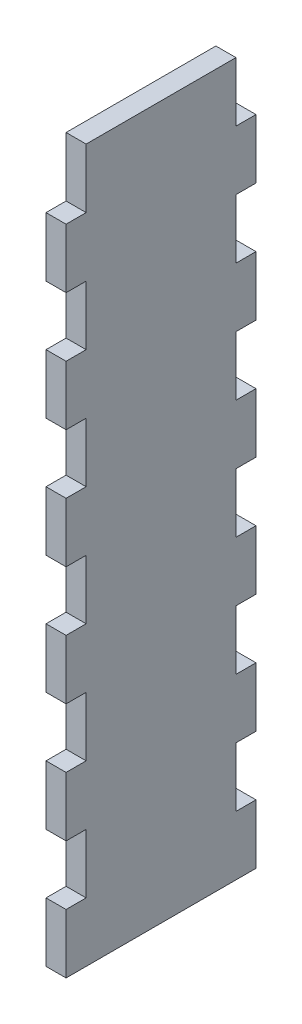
ISO-10303-21;
HEADER;
FILE_DESCRIPTION(('STEP AP214'),'2;1');
FILE_NAME('part.step','',(''),(''),'','','');
FILE_SCHEMA(('AUTOMOTIVE_DESIGN { 1 0 10303 214 1 1 1 1 }'));
ENDSEC;
DATA;
#1=APPLICATION_CONTEXT('core data for automotive mechanical design processes');
#2=APPLICATION_PROTOCOL_DEFINITION('international standard','automotive_design',2000,#1);
#3=PRODUCT_CONTEXT('',#1,'mechanical');
#4=PRODUCT('Part','Part','',(#3));
#5=PRODUCT_RELATED_PRODUCT_CATEGORY('part','',(#4));
#6=PRODUCT_DEFINITION_FORMATION('','',#4);
#7=PRODUCT_DEFINITION_CONTEXT('part definition',#1,'design');
#8=PRODUCT_DEFINITION('design','',#6,#7);
#9=PRODUCT_DEFINITION_SHAPE('','',#8);
#10=(LENGTH_UNIT() NAMED_UNIT(*) SI_UNIT(.MILLI.,.METRE.));
#11=(NAMED_UNIT(*) PLANE_ANGLE_UNIT() SI_UNIT($,.RADIAN.));
#12=(NAMED_UNIT(*) SI_UNIT($,.STERADIAN.) SOLID_ANGLE_UNIT());
#13=UNCERTAINTY_MEASURE_WITH_UNIT(LENGTH_MEASURE(1.E-05),#10,'distance_accuracy_value','');
#14=(GEOMETRIC_REPRESENTATION_CONTEXT(3) GLOBAL_UNCERTAINTY_ASSIGNED_CONTEXT((#13)) GLOBAL_UNIT_ASSIGNED_CONTEXT((#10,
#11,#12)) REPRESENTATION_CONTEXT('',''));
#15=CARTESIAN_POINT('',(0.,0.,0.));
#16=DIRECTION('',(0.,0.,1.));
#17=DIRECTION('',(1.,0.,0.));
#18=AXIS2_PLACEMENT_3D('',#15,#16,#17);
#19=CARTESIAN_POINT('',(3.38,60.,16.));
#20=DIRECTION('',(0.,0.,-1.));
#21=DIRECTION('',(0.,1.,0.));
#22=AXIS2_PLACEMENT_3D('',#19,#20,#21);
#23=PLANE('',#22);
#24=DIRECTION('',(1.,0.,0.));
#25=VECTOR('',#24,1.);
#26=CARTESIAN_POINT('',(0.,9.99999999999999,16.));
#27=LINE('',#26,#25);
#28=CARTESIAN_POINT('',(0.,9.99999999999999,16.));
#29=VERTEX_POINT('',#28);
#30=CARTESIAN_POINT('',(3.38,9.99999999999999,16.));
#31=VERTEX_POINT('',#30);
#32=EDGE_CURVE('E372',#29,#31,#27,.T.);
#33=ORIENTED_EDGE('',*,*,#32,.F.);
#34=DIRECTION('',(0.,-1.,0.));
#35=VECTOR('',#34,1.);
#36=CARTESIAN_POINT('',(0.,60.,16.));
#37=LINE('',#36,#35);
#38=CARTESIAN_POINT('',(0.,0.,16.));
#39=VERTEX_POINT('',#38);
#40=EDGE_CURVE('E695',#29,#39,#37,.T.);
#41=ORIENTED_EDGE('',*,*,#40,.T.);
#42=DIRECTION('',(1.,0.,0.));
#43=VECTOR('',#42,1.);
#44=CARTESIAN_POINT('',(0.,0.,16.));
#45=LINE('',#44,#43);
#46=CARTESIAN_POINT('',(3.38,0.,16.));
#47=VERTEX_POINT('',#46);
#48=EDGE_CURVE('E566',#39,#47,#45,.T.);
#49=ORIENTED_EDGE('',*,*,#48,.T.);
#50=DIRECTION('',(0.,-1.,0.));
#51=VECTOR('',#50,1.);
#52=CARTESIAN_POINT('',(3.38,60.,16.));
#53=LINE('',#52,#51);
#54=EDGE_CURVE('E715',#31,#47,#53,.T.);
#55=ORIENTED_EDGE('',*,*,#54,.F.);
#56=EDGE_LOOP('',(#33,#41,#49,#55));
#57=FACE_BOUND('',#56,.T.);
#58=ADVANCED_FACE('F35',(#57),#23,.F.);
#59=DIRECTION('',(1.,0.,0.));
#60=VECTOR('',#59,1.);
#61=CARTESIAN_POINT('',(0.,20.,16.));
#62=LINE('',#61,#60);
#63=CARTESIAN_POINT('',(0.,20.,16.));
#64=VERTEX_POINT('',#63);
#65=CARTESIAN_POINT('',(3.38,20.,16.));
#66=VERTEX_POINT('',#65);
#67=EDGE_CURVE('E398',#64,#66,#62,.T.);
#68=ORIENTED_EDGE('',*,*,#67,.T.);
#69=CARTESIAN_POINT('',(3.38,30.,16.));
#70=VERTEX_POINT('',#69);
#71=EDGE_CURVE('E649',#70,#66,#53,.T.);
#72=ORIENTED_EDGE('',*,*,#71,.F.);
#73=DIRECTION('',(1.,0.,0.));
#74=VECTOR('',#73,1.);
#75=CARTESIAN_POINT('',(0.,30.,16.));
#76=LINE('',#75,#74);
#77=CARTESIAN_POINT('',(0.,30.,16.));
#78=VERTEX_POINT('',#77);
#79=EDGE_CURVE('E377',#78,#70,#76,.T.);
#80=ORIENTED_EDGE('',*,*,#79,.F.);
#81=EDGE_CURVE('E661',#78,#64,#37,.T.);
#82=ORIENTED_EDGE('',*,*,#81,.T.);
#83=EDGE_LOOP('',(#68,#72,#80,#82));
#84=FACE_BOUND('',#83,.T.);
#85=ADVANCED_FACE('F706',(#84),#23,.F.);
#86=DIRECTION('',(1.,0.,0.));
#87=VECTOR('',#86,1.);
#88=CARTESIAN_POINT('',(0.,-50.,16.));
#89=LINE('',#88,#87);
#90=CARTESIAN_POINT('',(0.,-50.,16.));
#91=VERTEX_POINT('',#90);
#92=CARTESIAN_POINT('',(3.38,-50.,16.));
#93=VERTEX_POINT('',#92);
#94=EDGE_CURVE('E483',#91,#93,#89,.T.);
#95=ORIENTED_EDGE('',*,*,#94,.F.);
#96=CARTESIAN_POINT('',(0.,-60.,16.));
#97=VERTEX_POINT('',#96);
#98=EDGE_CURVE('E657',#91,#97,#37,.T.);
#99=ORIENTED_EDGE('',*,*,#98,.T.);
#100=DIRECTION('',(-1.,0.,0.));
#101=VECTOR('',#100,1.);
#102=CARTESIAN_POINT('',(3.38,-60.,16.));
#103=LINE('',#102,#101);
#104=CARTESIAN_POINT('',(3.38,-60.,16.));
#105=VERTEX_POINT('',#104);
#106=EDGE_CURVE('E12',#105,#97,#103,.T.);
#107=ORIENTED_EDGE('',*,*,#106,.F.);
#108=EDGE_CURVE('E644',#93,#105,#53,.T.);
#109=ORIENTED_EDGE('',*,*,#108,.F.);
#110=EDGE_LOOP('',(#95,#99,#107,#109));
#111=FACE_BOUND('',#110,.T.);
#112=ADVANCED_FACE('F686',(#111),#23,.F.);
#113=DIRECTION('',(1.,0.,0.));
#114=VECTOR('',#113,1.);
#115=CARTESIAN_POINT('',(0.,-40.,16.));
#116=LINE('',#115,#114);
#117=CARTESIAN_POINT('',(0.,-40.,16.));
#118=VERTEX_POINT('',#117);
#119=CARTESIAN_POINT('',(3.38,-40.,16.));
#120=VERTEX_POINT('',#119);
#121=EDGE_CURVE('E515',#118,#120,#116,.T.);
#122=ORIENTED_EDGE('',*,*,#121,.T.);
#123=CARTESIAN_POINT('',(3.38,-30.,16.));
#124=VERTEX_POINT('',#123);
#125=EDGE_CURVE('E720',#124,#120,#53,.T.);
#126=ORIENTED_EDGE('',*,*,#125,.F.);
#127=DIRECTION('',(1.,0.,0.));
#128=VECTOR('',#127,1.);
#129=CARTESIAN_POINT('',(0.,-30.,16.));
#130=LINE('',#129,#128);
#131=CARTESIAN_POINT('',(0.,-30.,16.));
#132=VERTEX_POINT('',#131);
#133=EDGE_CURVE('E488',#132,#124,#130,.T.);
#134=ORIENTED_EDGE('',*,*,#133,.F.);
#135=EDGE_CURVE('E688',#132,#118,#37,.T.);
#136=ORIENTED_EDGE('',*,*,#135,.T.);
#137=EDGE_LOOP('',(#122,#126,#134,#136));
#138=FACE_BOUND('',#137,.T.);
#139=ADVANCED_FACE('F725',(#138),#23,.F.);
#140=DIRECTION('',(1.,0.,0.));
#141=VECTOR('',#140,1.);
#142=CARTESIAN_POINT('',(0.,-20.,16.));
#143=LINE('',#142,#141);
#144=CARTESIAN_POINT('',(0.,-20.,16.));
#145=VERTEX_POINT('',#144);
#146=CARTESIAN_POINT('',(3.38,-20.,16.));
#147=VERTEX_POINT('',#146);
#148=EDGE_CURVE('E491',#145,#147,#143,.T.);
#149=ORIENTED_EDGE('',*,*,#148,.T.);
#150=CARTESIAN_POINT('',(3.38,-10.,16.));
#151=VERTEX_POINT('',#150);
#152=EDGE_CURVE('E717',#151,#147,#53,.T.);
#153=ORIENTED_EDGE('',*,*,#152,.F.);
#154=DIRECTION('',(1.,0.,0.));
#155=VECTOR('',#154,1.);
#156=CARTESIAN_POINT('',(0.,-10.,16.));
#157=LINE('',#156,#155);
#158=CARTESIAN_POINT('',(0.,-10.,16.));
#159=VERTEX_POINT('',#158);
#160=EDGE_CURVE('E563',#159,#151,#157,.T.);
#161=ORIENTED_EDGE('',*,*,#160,.F.);
#162=EDGE_CURVE('E690',#159,#145,#37,.T.);
#163=ORIENTED_EDGE('',*,*,#162,.T.);
#164=EDGE_LOOP('',(#149,#153,#161,#163));
#165=FACE_BOUND('',#164,.T.);
#166=ADVANCED_FACE('F757',(#165),#23,.F.);
#167=CARTESIAN_POINT('',(0.,50.,16.));
#168=VERTEX_POINT('',#167);
#169=CARTESIAN_POINT('',(0.,40.,16.));
#170=VERTEX_POINT('',#169);
#171=EDGE_CURVE('E658',#168,#170,#37,.T.);
#172=ORIENTED_EDGE('',*,*,#171,.T.);
#173=DIRECTION('',(1.,0.,0.));
#174=VECTOR('',#173,1.);
#175=CARTESIAN_POINT('',(0.,40.,16.));
#176=LINE('',#175,#174);
#177=CARTESIAN_POINT('',(3.38,40.,16.));
#178=VERTEX_POINT('',#177);
#179=EDGE_CURVE('E350',#170,#178,#176,.T.);
#180=ORIENTED_EDGE('',*,*,#179,.T.);
#181=CARTESIAN_POINT('',(3.38,50.,16.));
#182=VERTEX_POINT('',#181);
#183=EDGE_CURVE('E645',#182,#178,#53,.T.);
#184=ORIENTED_EDGE('',*,*,#183,.F.);
#185=DIRECTION('',(1.,0.,0.));
#186=VECTOR('',#185,1.);
#187=CARTESIAN_POINT('',(0.,50.,16.));
#188=LINE('',#187,#186);
#189=EDGE_CURVE('E630',#168,#182,#188,.T.);
#190=ORIENTED_EDGE('',*,*,#189,.F.);
#191=EDGE_LOOP('',(#172,#180,#184,#190));
#192=FACE_BOUND('',#191,.T.);
#193=ADVANCED_FACE('F751',(#192),#23,.F.);
#194=CARTESIAN_POINT('',(3.38,0.,0.));
#195=DIRECTION('',(1.,0.,0.));
#196=DIRECTION('',(0.,0.,-1.));
#197=AXIS2_PLACEMENT_3D('',#194,#195,#196);
#198=PLANE('',#197);
#199=DIRECTION('',(0.,0.,-1.));
#200=VECTOR('',#199,1.);
#201=CARTESIAN_POINT('',(3.38,9.99999999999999,0.));
#202=LINE('',#201,#200);
#203=CARTESIAN_POINT('',(3.38,9.99999999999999,-12.62));
#204=VERTEX_POINT('',#203);
#205=CARTESIAN_POINT('',(3.38,9.99999999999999,-16.));
#206=VERTEX_POINT('',#205);
#207=EDGE_CURVE('E407',#204,#206,#202,.T.);
#208=ORIENTED_EDGE('',*,*,#207,.F.);
#209=DIRECTION('',(0.,-1.,0.));
#210=VECTOR('',#209,1.);
#211=CARTESIAN_POINT('',(3.38,0.,-12.62));
#212=LINE('',#211,#210);
#213=CARTESIAN_POINT('',(3.38,20.,-12.62));
#214=VERTEX_POINT('',#213);
#215=EDGE_CURVE('E416',#214,#204,#212,.T.);
#216=ORIENTED_EDGE('',*,*,#215,.F.);
#217=DIRECTION('',(0.,0.,1.));
#218=VECTOR('',#217,1.);
#219=CARTESIAN_POINT('',(3.38,20.,0.));
#220=LINE('',#219,#218);
#221=CARTESIAN_POINT('',(3.38,20.,-16.));
#222=VERTEX_POINT('',#221);
#223=EDGE_CURVE('E413',#222,#214,#220,.T.);
#224=ORIENTED_EDGE('',*,*,#223,.F.);
#225=DIRECTION('',(0.,1.,0.));
#226=VECTOR('',#225,1.);
#227=CARTESIAN_POINT('',(3.38,60.,-16.));
#228=LINE('',#227,#226);
#229=CARTESIAN_POINT('',(3.38,30.,-16.));
#230=VERTEX_POINT('',#229);
#231=EDGE_CURVE('E796',#222,#230,#228,.T.);
#232=ORIENTED_EDGE('',*,*,#231,.T.);
#233=DIRECTION('',(0.,0.,1.));
#234=VECTOR('',#233,1.);
#235=CARTESIAN_POINT('',(3.38,30.,0.));
#236=LINE('',#235,#234);
#237=CARTESIAN_POINT('',(3.38,30.,-12.62));
#238=VERTEX_POINT('',#237);
#239=EDGE_CURVE('E451',#230,#238,#236,.T.);
#240=ORIENTED_EDGE('',*,*,#239,.T.);
#241=DIRECTION('',(0.,1.,0.));
#242=VECTOR('',#241,1.);
#243=CARTESIAN_POINT('',(3.38,0.,-12.62));
#244=LINE('',#243,#242);
#245=CARTESIAN_POINT('',(3.38,40.,-12.62));
#246=VERTEX_POINT('',#245);
#247=EDGE_CURVE('E458',#238,#246,#244,.T.);
#248=ORIENTED_EDGE('',*,*,#247,.T.);
#249=DIRECTION('',(0.,0.,-1.));
#250=VECTOR('',#249,1.);
#251=CARTESIAN_POINT('',(3.38,40.,0.));
#252=LINE('',#251,#250);
#253=CARTESIAN_POINT('',(3.38,40.,-16.));
#254=VERTEX_POINT('',#253);
#255=EDGE_CURVE('E376',#246,#254,#252,.T.);
#256=ORIENTED_EDGE('',*,*,#255,.T.);
#257=CARTESIAN_POINT('',(3.38,50.,-16.));
#258=VERTEX_POINT('',#257);
#259=EDGE_CURVE('E642',#254,#258,#228,.T.);
#260=ORIENTED_EDGE('',*,*,#259,.T.);
#261=DIRECTION('',(0.,0.,-1.));
#262=VECTOR('',#261,1.);
#263=CARTESIAN_POINT('',(3.38,49.9999999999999,2.05292719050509E-13));
#264=LINE('',#263,#262);
#265=CARTESIAN_POINT('',(3.38,50.,-12.62));
#266=VERTEX_POINT('',#265);
#267=EDGE_CURVE('E432',#266,#258,#264,.T.);
#268=ORIENTED_EDGE('',*,*,#267,.F.);
#269=DIRECTION('',(0.,-1.,0.));
#270=VECTOR('',#269,1.);
#271=CARTESIAN_POINT('',(3.38,0.,-12.62));
#272=LINE('',#271,#270);
#273=CARTESIAN_POINT('',(3.38,60.,-12.62));
#274=VERTEX_POINT('',#273);
#275=EDGE_CURVE('E436',#274,#266,#272,.T.);
#276=ORIENTED_EDGE('',*,*,#275,.F.);
#277=DIRECTION('',(0.,0.,1.));
#278=VECTOR('',#277,1.);
#279=CARTESIAN_POINT('',(3.38,60.,16.));
#280=LINE('',#279,#278);
#281=CARTESIAN_POINT('',(3.38,60.,12.62));
#282=VERTEX_POINT('',#281);
#283=EDGE_CURVE('E640',#274,#282,#280,.T.);
#284=ORIENTED_EDGE('',*,*,#283,.T.);
#285=DIRECTION('',(0.,-1.,0.));
#286=VECTOR('',#285,1.);
#287=CARTESIAN_POINT('',(3.38,0.,12.62));
#288=LINE('',#287,#286);
#289=CARTESIAN_POINT('',(3.38,50.,12.62));
#290=VERTEX_POINT('',#289);
#291=EDGE_CURVE('E623',#282,#290,#288,.T.);
#292=ORIENTED_EDGE('',*,*,#291,.T.);
#293=DIRECTION('',(0.,0.,1.));
#294=VECTOR('',#293,1.);
#295=CARTESIAN_POINT('',(3.38,50.,-1.02646359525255E-13));
#296=LINE('',#295,#294);
#297=EDGE_CURVE('E444',#290,#182,#296,.T.);
#298=ORIENTED_EDGE('',*,*,#297,.T.);
#299=ORIENTED_EDGE('',*,*,#183,.T.);
#300=DIRECTION('',(0.,0.,1.));
#301=VECTOR('',#300,1.);
#302=CARTESIAN_POINT('',(3.38,40.,0.));
#303=LINE('',#302,#301);
#304=CARTESIAN_POINT('',(3.38,40.,12.62));
#305=VERTEX_POINT('',#304);
#306=EDGE_CURVE('E367',#305,#178,#303,.T.);
#307=ORIENTED_EDGE('',*,*,#306,.F.);
#308=DIRECTION('',(0.,1.,0.));
#309=VECTOR('',#308,1.);
#310=CARTESIAN_POINT('',(3.38,0.,12.62));
#311=LINE('',#310,#309);
#312=CARTESIAN_POINT('',(3.38,30.,12.62));
#313=VERTEX_POINT('',#312);
#314=EDGE_CURVE('E347',#313,#305,#311,.T.);
#315=ORIENTED_EDGE('',*,*,#314,.F.);
#316=DIRECTION('',(0.,0.,-1.));
#317=VECTOR('',#316,1.);
#318=CARTESIAN_POINT('',(3.38,30.,0.));
#319=LINE('',#318,#317);
#320=EDGE_CURVE('E364',#70,#313,#319,.T.);
#321=ORIENTED_EDGE('',*,*,#320,.F.);
#322=ORIENTED_EDGE('',*,*,#71,.T.);
#323=DIRECTION('',(0.,0.,-1.));
#324=VECTOR('',#323,1.);
#325=CARTESIAN_POINT('',(3.38,20.,0.));
#326=LINE('',#325,#324);
#327=CARTESIAN_POINT('',(3.38,20.,12.62));
#328=VERTEX_POINT('',#327);
#329=EDGE_CURVE('E383',#66,#328,#326,.T.);
#330=ORIENTED_EDGE('',*,*,#329,.T.);
#331=DIRECTION('',(0.,-1.,0.));
#332=VECTOR('',#331,1.);
#333=CARTESIAN_POINT('',(3.38,0.,12.62));
#334=LINE('',#333,#332);
#335=CARTESIAN_POINT('',(3.38,9.99999999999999,12.62));
#336=VERTEX_POINT('',#335);
#337=EDGE_CURVE('E391',#328,#336,#334,.T.);
#338=ORIENTED_EDGE('',*,*,#337,.T.);
#339=DIRECTION('',(0.,0.,1.));
#340=VECTOR('',#339,1.);
#341=CARTESIAN_POINT('',(3.38,9.99999999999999,0.));
#342=LINE('',#341,#340);
#343=EDGE_CURVE('E388',#336,#31,#342,.T.);
#344=ORIENTED_EDGE('',*,*,#343,.T.);
#345=ORIENTED_EDGE('',*,*,#54,.T.);
#346=DIRECTION('',(0.,0.,-1.));
#347=VECTOR('',#346,1.);
#348=CARTESIAN_POINT('',(3.38,0.,0.));
#349=LINE('',#348,#347);
#350=CARTESIAN_POINT('',(3.38,0.,12.62));
#351=VERTEX_POINT('',#350);
#352=EDGE_CURVE('E548',#47,#351,#349,.T.);
#353=ORIENTED_EDGE('',*,*,#352,.T.);
#354=DIRECTION('',(0.,-1.,0.));
#355=VECTOR('',#354,1.);
#356=CARTESIAN_POINT('',(3.38,0.,12.62));
#357=LINE('',#356,#355);
#358=CARTESIAN_POINT('',(3.38,-10.,12.62));
#359=VERTEX_POINT('',#358);
#360=EDGE_CURVE('E557',#351,#359,#357,.T.);
#361=ORIENTED_EDGE('',*,*,#360,.T.);
#362=DIRECTION('',(0.,0.,1.));
#363=VECTOR('',#362,1.);
#364=CARTESIAN_POINT('',(3.38,-10.,0.));
#365=LINE('',#364,#363);
#366=EDGE_CURVE('E554',#359,#151,#365,.T.);
#367=ORIENTED_EDGE('',*,*,#366,.T.);
#368=ORIENTED_EDGE('',*,*,#152,.T.);
#369=DIRECTION('',(0.,0.,-1.));
#370=VECTOR('',#369,1.);
#371=CARTESIAN_POINT('',(3.38,-20.,0.));
#372=LINE('',#371,#370);
#373=CARTESIAN_POINT('',(3.38,-20.,12.62));
#374=VERTEX_POINT('',#373);
#375=EDGE_CURVE('E473',#147,#374,#372,.T.);
#376=ORIENTED_EDGE('',*,*,#375,.T.);
#377=DIRECTION('',(0.,-1.,0.));
#378=VECTOR('',#377,1.);
#379=CARTESIAN_POINT('',(3.38,0.,12.62));
#380=LINE('',#379,#378);
#381=CARTESIAN_POINT('',(3.38,-30.,12.62));
#382=VERTEX_POINT('',#381);
#383=EDGE_CURVE('E482',#374,#382,#380,.T.);
#384=ORIENTED_EDGE('',*,*,#383,.T.);
#385=DIRECTION('',(0.,0.,1.));
#386=VECTOR('',#385,1.);
#387=CARTESIAN_POINT('',(3.38,-30.,0.));
#388=LINE('',#387,#386);
#389=EDGE_CURVE('E479',#382,#124,#388,.T.);
#390=ORIENTED_EDGE('',*,*,#389,.T.);
#391=ORIENTED_EDGE('',*,*,#125,.T.);
#392=DIRECTION('',(0.,0.,-1.));
#393=VECTOR('',#392,1.);
#394=CARTESIAN_POINT('',(3.38,-40.,0.));
#395=LINE('',#394,#393);
#396=CARTESIAN_POINT('',(3.38,-40.,12.62));
#397=VERTEX_POINT('',#396);
#398=EDGE_CURVE('E500',#120,#397,#395,.T.);
#399=ORIENTED_EDGE('',*,*,#398,.T.);
#400=DIRECTION('',(0.,-1.,0.));
#401=VECTOR('',#400,1.);
#402=CARTESIAN_POINT('',(3.38,0.,12.62));
#403=LINE('',#402,#401);
#404=CARTESIAN_POINT('',(3.38,-50.,12.62));
#405=VERTEX_POINT('',#404);
#406=EDGE_CURVE('E508',#397,#405,#403,.T.);
#407=ORIENTED_EDGE('',*,*,#406,.T.);
#408=DIRECTION('',(0.,0.,1.));
#409=VECTOR('',#408,1.);
#410=CARTESIAN_POINT('',(3.38,-50.,0.));
#411=LINE('',#410,#409);
#412=EDGE_CURVE('E505',#405,#93,#411,.T.);
#413=ORIENTED_EDGE('',*,*,#412,.T.);
#414=ORIENTED_EDGE('',*,*,#108,.T.);
#415=DIRECTION('',(0.,0.,-1.));
#416=VECTOR('',#415,1.);
#417=CARTESIAN_POINT('',(3.38,-60.,16.));
#418=LINE('',#417,#416);
#419=CARTESIAN_POINT('',(3.38,-60.,-16.));
#420=VERTEX_POINT('',#419);
#421=EDGE_CURVE('E648',#105,#420,#418,.T.);
#422=ORIENTED_EDGE('',*,*,#421,.T.);
#423=CARTESIAN_POINT('',(3.38,-50.,-16.));
#424=VERTEX_POINT('',#423);
#425=EDGE_CURVE('E637',#420,#424,#228,.T.);
#426=ORIENTED_EDGE('',*,*,#425,.T.);
#427=DIRECTION('',(0.,0.,-1.));
#428=VECTOR('',#427,1.);
#429=CARTESIAN_POINT('',(3.38,-50.,-1.02646359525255E-13));
#430=LINE('',#429,#428);
#431=CARTESIAN_POINT('',(3.38,-50.,-12.62));
#432=VERTEX_POINT('',#431);
#433=EDGE_CURVE('E524',#432,#424,#430,.T.);
#434=ORIENTED_EDGE('',*,*,#433,.F.);
#435=DIRECTION('',(0.,-1.,0.));
#436=VECTOR('',#435,1.);
#437=CARTESIAN_POINT('',(3.38,0.,-12.62));
#438=LINE('',#437,#436);
#439=CARTESIAN_POINT('',(3.38,-40.,-12.62));
#440=VERTEX_POINT('',#439);
#441=EDGE_CURVE('E534',#440,#432,#438,.T.);
#442=ORIENTED_EDGE('',*,*,#441,.F.);
#443=DIRECTION('',(0.,0.,1.));
#444=VECTOR('',#443,1.);
#445=CARTESIAN_POINT('',(3.38,-40.,0.));
#446=LINE('',#445,#444);
#447=CARTESIAN_POINT('',(3.38,-40.,-16.));
#448=VERTEX_POINT('',#447);
#449=EDGE_CURVE('E531',#448,#440,#446,.T.);
#450=ORIENTED_EDGE('',*,*,#449,.F.);
#451=CARTESIAN_POINT('',(3.38,-30.,-16.));
#452=VERTEX_POINT('',#451);
#453=EDGE_CURVE('E641',#448,#452,#228,.T.);
#454=ORIENTED_EDGE('',*,*,#453,.T.);
#455=DIRECTION('',(0.,0.,-1.));
#456=VECTOR('',#455,1.);
#457=CARTESIAN_POINT('',(3.38,-30.,0.));
#458=LINE('',#457,#456);
#459=CARTESIAN_POINT('',(3.38,-30.,-12.62));
#460=VERTEX_POINT('',#459);
#461=EDGE_CURVE('E576',#460,#452,#458,.T.);
#462=ORIENTED_EDGE('',*,*,#461,.F.);
#463=DIRECTION('',(0.,-1.,0.));
#464=VECTOR('',#463,1.);
#465=CARTESIAN_POINT('',(3.38,0.,-12.62));
#466=LINE('',#465,#464);
#467=CARTESIAN_POINT('',(3.38,-20.,-12.62));
#468=VERTEX_POINT('',#467);
#469=EDGE_CURVE('E585',#468,#460,#466,.T.);
#470=ORIENTED_EDGE('',*,*,#469,.F.);
#471=DIRECTION('',(0.,0.,1.));
#472=VECTOR('',#471,1.);
#473=CARTESIAN_POINT('',(3.38,-20.,0.));
#474=LINE('',#473,#472);
#475=CARTESIAN_POINT('',(3.38,-20.,-16.));
#476=VERTEX_POINT('',#475);
#477=EDGE_CURVE('E490',#476,#468,#474,.T.);
#478=ORIENTED_EDGE('',*,*,#477,.F.);
#479=CARTESIAN_POINT('',(3.38,-10.,-16.));
#480=VERTEX_POINT('',#479);
#481=EDGE_CURVE('E802',#476,#480,#228,.T.);
#482=ORIENTED_EDGE('',*,*,#481,.T.);
#483=DIRECTION('',(0.,0.,-1.));
#484=VECTOR('',#483,1.);
#485=CARTESIAN_POINT('',(3.38,-10.,0.));
#486=LINE('',#485,#484);
#487=CARTESIAN_POINT('',(3.38,-10.,-12.62));
#488=VERTEX_POINT('',#487);
#489=EDGE_CURVE('E600',#488,#480,#486,.T.);
#490=ORIENTED_EDGE('',*,*,#489,.F.);
#491=DIRECTION('',(0.,-1.,0.));
#492=VECTOR('',#491,1.);
#493=CARTESIAN_POINT('',(3.38,0.,-12.62));
#494=LINE('',#493,#492);
#495=CARTESIAN_POINT('',(3.38,0.,-12.62));
#496=VERTEX_POINT('',#495);
#497=EDGE_CURVE('E609',#496,#488,#494,.T.);
#498=ORIENTED_EDGE('',*,*,#497,.F.);
#499=DIRECTION('',(0.,0.,1.));
#500=VECTOR('',#499,1.);
#501=CARTESIAN_POINT('',(3.38,0.,0.));
#502=LINE('',#501,#500);
#503=CARTESIAN_POINT('',(3.38,0.,-16.));
#504=VERTEX_POINT('',#503);
#505=EDGE_CURVE('E565',#504,#496,#502,.T.);
#506=ORIENTED_EDGE('',*,*,#505,.F.);
#507=EDGE_CURVE('E798',#504,#206,#228,.T.);
#508=ORIENTED_EDGE('',*,*,#507,.T.);
#509=EDGE_LOOP('',(#208,#216,#224,#232,#240,#248,#256,#260,#268,#276,#284,#292,#298,#299,#307,
#315,#321,#322,#330,#338,#344,#345,#353,#361,#367,#368,#376,#384,#390,#391,#399,#407,#413,#414,
#422,#426,#434,#442,#450,#454,#462,#470,#478,#482,#490,#498,#506,#508));
#510=FACE_BOUND('',#509,.T.);
#511=ADVANCED_FACE('F679',(#510),#198,.T.);
#512=CARTESIAN_POINT('',(0.,0.,0.));
#513=DIRECTION('',(1.,0.,0.));
#514=DIRECTION('',(0.,0.,-1.));
#515=AXIS2_PLACEMENT_3D('',#512,#513,#514);
#516=PLANE('',#515);
#517=DIRECTION('',(0.,-1.,0.));
#518=VECTOR('',#517,1.);
#519=CARTESIAN_POINT('',(0.,0.,-12.62));
#520=LINE('',#519,#518);
#521=CARTESIAN_POINT('',(0.,20.,-12.62));
#522=VERTEX_POINT('',#521);
#523=CARTESIAN_POINT('',(0.,9.99999999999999,-12.62));
#524=VERTEX_POINT('',#523);
#525=EDGE_CURVE('E406',#522,#524,#520,.T.);
#526=ORIENTED_EDGE('',*,*,#525,.T.);
#527=DIRECTION('',(0.,0.,-1.));
#528=VECTOR('',#527,1.);
#529=CARTESIAN_POINT('',(0.,9.99999999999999,0.));
#530=LINE('',#529,#528);
#531=CARTESIAN_POINT('',(0.,9.99999999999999,-16.));
#532=VERTEX_POINT('',#531);
#533=EDGE_CURVE('E409',#524,#532,#530,.T.);
#534=ORIENTED_EDGE('',*,*,#533,.T.);
#535=DIRECTION('',(0.,1.,0.));
#536=VECTOR('',#535,1.);
#537=CARTESIAN_POINT('',(0.,60.,-16.));
#538=LINE('',#537,#536);
#539=CARTESIAN_POINT('',(0.,0.,-16.));
#540=VERTEX_POINT('',#539);
#541=EDGE_CURVE('E844',#540,#532,#538,.T.);
#542=ORIENTED_EDGE('',*,*,#541,.F.);
#543=DIRECTION('',(0.,0.,1.));
#544=VECTOR('',#543,1.);
#545=CARTESIAN_POINT('',(0.,0.,0.));
#546=LINE('',#545,#544);
#547=CARTESIAN_POINT('',(0.,0.,-12.62));
#548=VERTEX_POINT('',#547);
#549=EDGE_CURVE('E596',#540,#548,#546,.T.);
#550=ORIENTED_EDGE('',*,*,#549,.T.);
#551=DIRECTION('',(0.,-1.,0.));
#552=VECTOR('',#551,1.);
#553=CARTESIAN_POINT('',(0.,0.,-12.62));
#554=LINE('',#553,#552);
#555=CARTESIAN_POINT('',(0.,-10.,-12.62));
#556=VERTEX_POINT('',#555);
#557=EDGE_CURVE('E599',#548,#556,#554,.T.);
#558=ORIENTED_EDGE('',*,*,#557,.T.);
#559=DIRECTION('',(0.,0.,-1.));
#560=VECTOR('',#559,1.);
#561=CARTESIAN_POINT('',(0.,-10.,0.));
#562=LINE('',#561,#560);
#563=CARTESIAN_POINT('',(0.,-10.,-16.));
#564=VERTEX_POINT('',#563);
#565=EDGE_CURVE('E603',#556,#564,#562,.T.);
#566=ORIENTED_EDGE('',*,*,#565,.T.);
#567=CARTESIAN_POINT('',(0.,-20.,-16.));
#568=VERTEX_POINT('',#567);
#569=EDGE_CURVE('E831',#568,#564,#538,.T.);
#570=ORIENTED_EDGE('',*,*,#569,.F.);
#571=DIRECTION('',(0.,0.,1.));
#572=VECTOR('',#571,1.);
#573=CARTESIAN_POINT('',(0.,-20.,0.));
#574=LINE('',#573,#572);
#575=CARTESIAN_POINT('',(0.,-20.,-12.62));
#576=VERTEX_POINT('',#575);
#577=EDGE_CURVE('E572',#568,#576,#574,.T.);
#578=ORIENTED_EDGE('',*,*,#577,.T.);
#579=DIRECTION('',(0.,-1.,0.));
#580=VECTOR('',#579,1.);
#581=CARTESIAN_POINT('',(0.,0.,-12.62));
#582=LINE('',#581,#580);
#583=CARTESIAN_POINT('',(0.,-30.,-12.62));
#584=VERTEX_POINT('',#583);
#585=EDGE_CURVE('E575',#576,#584,#582,.T.);
#586=ORIENTED_EDGE('',*,*,#585,.T.);
#587=DIRECTION('',(0.,0.,-1.));
#588=VECTOR('',#587,1.);
#589=CARTESIAN_POINT('',(0.,-30.,0.));
#590=LINE('',#589,#588);
#591=CARTESIAN_POINT('',(0.,-30.,-16.));
#592=VERTEX_POINT('',#591);
#593=EDGE_CURVE('E579',#584,#592,#590,.T.);
#594=ORIENTED_EDGE('',*,*,#593,.T.);
#595=CARTESIAN_POINT('',(0.,-40.,-16.));
#596=VERTEX_POINT('',#595);
#597=EDGE_CURVE('E655',#596,#592,#538,.T.);
#598=ORIENTED_EDGE('',*,*,#597,.F.);
#599=DIRECTION('',(0.,0.,1.));
#600=VECTOR('',#599,1.);
#601=CARTESIAN_POINT('',(0.,-40.,0.));
#602=LINE('',#601,#600);
#603=CARTESIAN_POINT('',(0.,-40.,-12.62));
#604=VERTEX_POINT('',#603);
#605=EDGE_CURVE('E520',#596,#604,#602,.T.);
#606=ORIENTED_EDGE('',*,*,#605,.T.);
#607=DIRECTION('',(0.,-1.,0.));
#608=VECTOR('',#607,1.);
#609=CARTESIAN_POINT('',(0.,0.,-12.62));
#610=LINE('',#609,#608);
#611=CARTESIAN_POINT('',(0.,-50.,-12.62));
#612=VERTEX_POINT('',#611);
#613=EDGE_CURVE('E523',#604,#612,#610,.T.);
#614=ORIENTED_EDGE('',*,*,#613,.T.);
#615=DIRECTION('',(0.,0.,-1.));
#616=VECTOR('',#615,1.);
#617=CARTESIAN_POINT('',(0.,-50.,-1.02646359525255E-13));
#618=LINE('',#617,#616);
#619=CARTESIAN_POINT('',(0.,-50.,-16.));
#620=VERTEX_POINT('',#619);
#621=EDGE_CURVE('E527',#612,#620,#618,.T.);
#622=ORIENTED_EDGE('',*,*,#621,.T.);
#623=CARTESIAN_POINT('',(0.,-60.,-16.));
#624=VERTEX_POINT('',#623);
#625=EDGE_CURVE('E651',#624,#620,#538,.T.);
#626=ORIENTED_EDGE('',*,*,#625,.F.);
#627=DIRECTION('',(0.,0.,-1.));
#628=VECTOR('',#627,1.);
#629=CARTESIAN_POINT('',(0.,-60.,16.));
#630=LINE('',#629,#628);
#631=EDGE_CURVE('E660',#97,#624,#630,.T.);
#632=ORIENTED_EDGE('',*,*,#631,.F.);
#633=ORIENTED_EDGE('',*,*,#98,.F.);
#634=DIRECTION('',(0.,0.,1.));
#635=VECTOR('',#634,1.);
#636=CARTESIAN_POINT('',(0.,-50.,0.));
#637=LINE('',#636,#635);
#638=CARTESIAN_POINT('',(0.,-50.,12.62));
#639=VERTEX_POINT('',#638);
#640=EDGE_CURVE('E497',#639,#91,#637,.T.);
#641=ORIENTED_EDGE('',*,*,#640,.F.);
#642=DIRECTION('',(0.,-1.,0.));
#643=VECTOR('',#642,1.);
#644=CARTESIAN_POINT('',(0.,0.,12.62));
#645=LINE('',#644,#643);
#646=CARTESIAN_POINT('',(0.,-40.,12.62));
#647=VERTEX_POINT('',#646);
#648=EDGE_CURVE('E499',#647,#639,#645,.T.);
#649=ORIENTED_EDGE('',*,*,#648,.F.);
#650=DIRECTION('',(0.,0.,-1.));
#651=VECTOR('',#650,1.);
#652=CARTESIAN_POINT('',(0.,-40.,0.));
#653=LINE('',#652,#651);
#654=EDGE_CURVE('E502',#118,#647,#653,.T.);
#655=ORIENTED_EDGE('',*,*,#654,.F.);
#656=ORIENTED_EDGE('',*,*,#135,.F.);
#657=DIRECTION('',(0.,0.,1.));
#658=VECTOR('',#657,1.);
#659=CARTESIAN_POINT('',(0.,-30.,0.));
#660=LINE('',#659,#658);
#661=CARTESIAN_POINT('',(0.,-30.,12.62));
#662=VERTEX_POINT('',#661);
#663=EDGE_CURVE('E470',#662,#132,#660,.T.);
#664=ORIENTED_EDGE('',*,*,#663,.F.);
#665=DIRECTION('',(0.,-1.,0.));
#666=VECTOR('',#665,1.);
#667=CARTESIAN_POINT('',(0.,0.,12.62));
#668=LINE('',#667,#666);
#669=CARTESIAN_POINT('',(0.,-20.,12.62));
#670=VERTEX_POINT('',#669);
#671=EDGE_CURVE('E472',#670,#662,#668,.T.);
#672=ORIENTED_EDGE('',*,*,#671,.F.);
#673=DIRECTION('',(0.,0.,-1.));
#674=VECTOR('',#673,1.);
#675=CARTESIAN_POINT('',(0.,-20.,0.));
#676=LINE('',#675,#674);
#677=EDGE_CURVE('E475',#145,#670,#676,.T.);
#678=ORIENTED_EDGE('',*,*,#677,.F.);
#679=ORIENTED_EDGE('',*,*,#162,.F.);
#680=DIRECTION('',(0.,0.,1.));
#681=VECTOR('',#680,1.);
#682=CARTESIAN_POINT('',(0.,-10.,0.));
#683=LINE('',#682,#681);
#684=CARTESIAN_POINT('',(0.,-10.,12.62));
#685=VERTEX_POINT('',#684);
#686=EDGE_CURVE('E545',#685,#159,#683,.T.);
#687=ORIENTED_EDGE('',*,*,#686,.F.);
#688=DIRECTION('',(0.,-1.,0.));
#689=VECTOR('',#688,1.);
#690=CARTESIAN_POINT('',(0.,0.,12.62));
#691=LINE('',#690,#689);
#692=CARTESIAN_POINT('',(0.,0.,12.62));
#693=VERTEX_POINT('',#692);
#694=EDGE_CURVE('E547',#693,#685,#691,.T.);
#695=ORIENTED_EDGE('',*,*,#694,.F.);
#696=DIRECTION('',(0.,0.,-1.));
#697=VECTOR('',#696,1.);
#698=CARTESIAN_POINT('',(0.,0.,0.));
#699=LINE('',#698,#697);
#700=EDGE_CURVE('E550',#39,#693,#699,.T.);
#701=ORIENTED_EDGE('',*,*,#700,.F.);
#702=ORIENTED_EDGE('',*,*,#40,.F.);
#703=DIRECTION('',(0.,0.,1.));
#704=VECTOR('',#703,1.);
#705=CARTESIAN_POINT('',(0.,9.99999999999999,0.));
#706=LINE('',#705,#704);
#707=CARTESIAN_POINT('',(0.,9.99999999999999,12.62));
#708=VERTEX_POINT('',#707);
#709=EDGE_CURVE('E380',#708,#29,#706,.T.);
#710=ORIENTED_EDGE('',*,*,#709,.F.);
#711=DIRECTION('',(0.,-1.,0.));
#712=VECTOR('',#711,1.);
#713=CARTESIAN_POINT('',(0.,0.,12.62));
#714=LINE('',#713,#712);
#715=CARTESIAN_POINT('',(0.,20.,12.62));
#716=VERTEX_POINT('',#715);
#717=EDGE_CURVE('E382',#716,#708,#714,.T.);
#718=ORIENTED_EDGE('',*,*,#717,.F.);
#719=DIRECTION('',(0.,0.,-1.));
#720=VECTOR('',#719,1.);
#721=CARTESIAN_POINT('',(0.,20.,0.));
#722=LINE('',#721,#720);
#723=EDGE_CURVE('E385',#64,#716,#722,.T.);
#724=ORIENTED_EDGE('',*,*,#723,.F.);
#725=ORIENTED_EDGE('',*,*,#81,.F.);
#726=DIRECTION('',(0.,0.,-1.));
#727=VECTOR('',#726,1.);
#728=CARTESIAN_POINT('',(0.,30.,0.));
#729=LINE('',#728,#727);
#730=CARTESIAN_POINT('',(0.,30.,12.62));
#731=VERTEX_POINT('',#730);
#732=EDGE_CURVE('E351',#78,#731,#729,.T.);
#733=ORIENTED_EDGE('',*,*,#732,.T.);
#734=DIRECTION('',(0.,1.,0.));
#735=VECTOR('',#734,1.);
#736=CARTESIAN_POINT('',(0.,0.,12.62));
#737=LINE('',#736,#735);
#738=CARTESIAN_POINT('',(0.,40.,12.62));
#739=VERTEX_POINT('',#738);
#740=EDGE_CURVE('E344',#731,#739,#737,.T.);
#741=ORIENTED_EDGE('',*,*,#740,.T.);
#742=DIRECTION('',(0.,0.,1.));
#743=VECTOR('',#742,1.);
#744=CARTESIAN_POINT('',(0.,40.,0.));
#745=LINE('',#744,#743);
#746=EDGE_CURVE('E354',#739,#170,#745,.T.);
#747=ORIENTED_EDGE('',*,*,#746,.T.);
#748=ORIENTED_EDGE('',*,*,#171,.F.);
#749=DIRECTION('',(0.,0.,1.));
#750=VECTOR('',#749,1.);
#751=CARTESIAN_POINT('',(0.,50.,-1.02646359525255E-13));
#752=LINE('',#751,#750);
#753=CARTESIAN_POINT('',(0.,50.,12.62));
#754=VERTEX_POINT('',#753);
#755=EDGE_CURVE('E620',#754,#168,#752,.T.);
#756=ORIENTED_EDGE('',*,*,#755,.F.);
#757=DIRECTION('',(0.,-1.,0.));
#758=VECTOR('',#757,1.);
#759=CARTESIAN_POINT('',(0.,0.,12.62));
#760=LINE('',#759,#758);
#761=CARTESIAN_POINT('',(0.,60.,12.62));
#762=VERTEX_POINT('',#761);
#763=EDGE_CURVE('E622',#762,#754,#760,.T.);
#764=ORIENTED_EDGE('',*,*,#763,.F.);
#765=DIRECTION('',(0.,0.,1.));
#766=VECTOR('',#765,1.);
#767=CARTESIAN_POINT('',(0.,60.,16.));
#768=LINE('',#767,#766);
#769=CARTESIAN_POINT('',(0.,60.,-12.62));
#770=VERTEX_POINT('',#769);
#771=EDGE_CURVE('E654',#770,#762,#768,.T.);
#772=ORIENTED_EDGE('',*,*,#771,.F.);
#773=DIRECTION('',(0.,-1.,0.));
#774=VECTOR('',#773,1.);
#775=CARTESIAN_POINT('',(0.,0.,-12.62));
#776=LINE('',#775,#774);
#777=CARTESIAN_POINT('',(0.,50.,-12.62));
#778=VERTEX_POINT('',#777);
#779=EDGE_CURVE('E428',#770,#778,#776,.T.);
#780=ORIENTED_EDGE('',*,*,#779,.T.);
#781=DIRECTION('',(0.,0.,-1.));
#782=VECTOR('',#781,1.);
#783=CARTESIAN_POINT('',(0.,49.9999999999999,2.05292719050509E-13));
#784=LINE('',#783,#782);
#785=CARTESIAN_POINT('',(0.,50.,-16.));
#786=VERTEX_POINT('',#785);
#787=EDGE_CURVE('E431',#778,#786,#784,.T.);
#788=ORIENTED_EDGE('',*,*,#787,.T.);
#789=CARTESIAN_POINT('',(0.,40.,-16.));
#790=VERTEX_POINT('',#789);
#791=EDGE_CURVE('E632',#790,#786,#538,.T.);
#792=ORIENTED_EDGE('',*,*,#791,.F.);
#793=DIRECTION('',(0.,0.,-1.));
#794=VECTOR('',#793,1.);
#795=CARTESIAN_POINT('',(0.,40.,0.));
#796=LINE('',#795,#794);
#797=CARTESIAN_POINT('',(0.,40.,-12.62));
#798=VERTEX_POINT('',#797);
#799=EDGE_CURVE('E448',#798,#790,#796,.T.);
#800=ORIENTED_EDGE('',*,*,#799,.F.);
#801=DIRECTION('',(0.,1.,0.));
#802=VECTOR('',#801,1.);
#803=CARTESIAN_POINT('',(0.,0.,-12.62));
#804=LINE('',#803,#802);
#805=CARTESIAN_POINT('',(0.,30.,-12.62));
#806=VERTEX_POINT('',#805);
#807=EDGE_CURVE('E450',#806,#798,#804,.T.);
#808=ORIENTED_EDGE('',*,*,#807,.F.);
#809=DIRECTION('',(0.,0.,1.));
#810=VECTOR('',#809,1.);
#811=CARTESIAN_POINT('',(0.,30.,0.));
#812=LINE('',#811,#810);
#813=CARTESIAN_POINT('',(0.,30.,-16.));
#814=VERTEX_POINT('',#813);
#815=EDGE_CURVE('E453',#814,#806,#812,.T.);
#816=ORIENTED_EDGE('',*,*,#815,.F.);
#817=CARTESIAN_POINT('',(0.,20.,-16.));
#818=VERTEX_POINT('',#817);
#819=EDGE_CURVE('E858',#818,#814,#538,.T.);
#820=ORIENTED_EDGE('',*,*,#819,.F.);
#821=DIRECTION('',(0.,0.,1.));
#822=VECTOR('',#821,1.);
#823=CARTESIAN_POINT('',(0.,20.,0.));
#824=LINE('',#823,#822);
#825=EDGE_CURVE('E403',#818,#522,#824,.T.);
#826=ORIENTED_EDGE('',*,*,#825,.T.);
#827=EDGE_LOOP('',(#526,#534,#542,#550,#558,#566,#570,#578,#586,#594,#598,#606,#614,#622,#626,
#632,#633,#641,#649,#655,#656,#664,#672,#678,#679,#687,#695,#701,#702,#710,#718,#724,#725,#733,
#741,#747,#748,#756,#764,#772,#780,#788,#792,#800,#808,#816,#820,#826));
#828=FACE_BOUND('',#827,.T.);
#829=ADVANCED_FACE('F362',(#828),#516,.F.);
#830=CARTESIAN_POINT('',(3.38,60.,-16.));
#831=DIRECTION('',(0.,0.,1.));
#832=DIRECTION('',(0.,-1.,0.));
#833=AXIS2_PLACEMENT_3D('',#830,#831,#832);
#834=PLANE('',#833);
#835=ORIENTED_EDGE('',*,*,#541,.T.);
#836=DIRECTION('',(1.,0.,0.));
#837=VECTOR('',#836,1.);
#838=CARTESIAN_POINT('',(0.,9.99999999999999,-16.));
#839=LINE('',#838,#837);
#840=EDGE_CURVE('E392',#532,#206,#839,.T.);
#841=ORIENTED_EDGE('',*,*,#840,.T.);
#842=ORIENTED_EDGE('',*,*,#507,.F.);
#843=DIRECTION('',(1.,0.,0.));
#844=VECTOR('',#843,1.);
#845=CARTESIAN_POINT('',(0.,0.,-16.));
#846=LINE('',#845,#844);
#847=EDGE_CURVE('E606',#540,#504,#846,.T.);
#848=ORIENTED_EDGE('',*,*,#847,.F.);
#849=EDGE_LOOP('',(#835,#841,#842,#848));
#850=FACE_BOUND('',#849,.T.);
#851=ADVANCED_FACE('F37',(#850),#834,.F.);
#852=DIRECTION('',(1.,0.,0.));
#853=VECTOR('',#852,1.);
#854=CARTESIAN_POINT('',(0.,40.,-16.));
#855=LINE('',#854,#853);
#856=EDGE_CURVE('E439',#790,#254,#855,.T.);
#857=ORIENTED_EDGE('',*,*,#856,.F.);
#858=ORIENTED_EDGE('',*,*,#791,.T.);
#859=DIRECTION('',(1.,0.,0.));
#860=VECTOR('',#859,1.);
#861=CARTESIAN_POINT('',(0.,50.,-16.));
#862=LINE('',#861,#860);
#863=EDGE_CURVE('E441',#786,#258,#862,.T.);
#864=ORIENTED_EDGE('',*,*,#863,.T.);
#865=ORIENTED_EDGE('',*,*,#259,.F.);
#866=EDGE_LOOP('',(#857,#858,#864,#865));
#867=FACE_BOUND('',#866,.T.);
#868=ADVANCED_FACE('F794',(#867),#834,.F.);
#869=ORIENTED_EDGE('',*,*,#231,.F.);
#870=DIRECTION('',(1.,0.,0.));
#871=VECTOR('',#870,1.);
#872=CARTESIAN_POINT('',(0.,20.,-16.));
#873=LINE('',#872,#871);
#874=EDGE_CURVE('E412',#818,#222,#873,.T.);
#875=ORIENTED_EDGE('',*,*,#874,.F.);
#876=ORIENTED_EDGE('',*,*,#819,.T.);
#877=DIRECTION('',(1.,0.,0.));
#878=VECTOR('',#877,1.);
#879=CARTESIAN_POINT('',(0.,30.,-16.));
#880=LINE('',#879,#878);
#881=EDGE_CURVE('E464',#814,#230,#880,.T.);
#882=ORIENTED_EDGE('',*,*,#881,.T.);
#883=EDGE_LOOP('',(#869,#875,#876,#882));
#884=FACE_BOUND('',#883,.T.);
#885=ADVANCED_FACE('F856',(#884),#834,.F.);
#886=ORIENTED_EDGE('',*,*,#625,.T.);
#887=DIRECTION('',(1.,0.,0.));
#888=VECTOR('',#887,1.);
#889=CARTESIAN_POINT('',(0.,-50.,-16.));
#890=LINE('',#889,#888);
#891=EDGE_CURVE('E509',#620,#424,#890,.T.);
#892=ORIENTED_EDGE('',*,*,#891,.T.);
#893=ORIENTED_EDGE('',*,*,#425,.F.);
#894=DIRECTION('',(-1.,0.,0.));
#895=VECTOR('',#894,1.);
#896=CARTESIAN_POINT('',(3.38,-60.,-16.));
#897=LINE('',#896,#895);
#898=EDGE_CURVE('E43',#420,#624,#897,.T.);
#899=ORIENTED_EDGE('',*,*,#898,.T.);
#900=EDGE_LOOP('',(#886,#892,#893,#899));
#901=FACE_BOUND('',#900,.T.);
#902=ADVANCED_FACE('F667',(#901),#834,.F.);
#903=ORIENTED_EDGE('',*,*,#569,.T.);
#904=DIRECTION('',(1.,0.,0.));
#905=VECTOR('',#904,1.);
#906=CARTESIAN_POINT('',(0.,-10.,-16.));
#907=LINE('',#906,#905);
#908=EDGE_CURVE('E417',#564,#480,#907,.T.);
#909=ORIENTED_EDGE('',*,*,#908,.T.);
#910=ORIENTED_EDGE('',*,*,#481,.F.);
#911=DIRECTION('',(1.,0.,0.));
#912=VECTOR('',#911,1.);
#913=CARTESIAN_POINT('',(0.,-20.,-16.));
#914=LINE('',#913,#912);
#915=EDGE_CURVE('E582',#568,#476,#914,.T.);
#916=ORIENTED_EDGE('',*,*,#915,.F.);
#917=EDGE_LOOP('',(#903,#909,#910,#916));
#918=FACE_BOUND('',#917,.T.);
#919=ADVANCED_FACE('F830',(#918),#834,.F.);
#920=ORIENTED_EDGE('',*,*,#453,.F.);
#921=DIRECTION('',(1.,0.,0.));
#922=VECTOR('',#921,1.);
#923=CARTESIAN_POINT('',(0.,-40.,-16.));
#924=LINE('',#923,#922);
#925=EDGE_CURVE('E530',#596,#448,#924,.T.);
#926=ORIENTED_EDGE('',*,*,#925,.F.);
#927=ORIENTED_EDGE('',*,*,#597,.T.);
#928=DIRECTION('',(1.,0.,0.));
#929=VECTOR('',#928,1.);
#930=CARTESIAN_POINT('',(0.,-30.,-16.));
#931=LINE('',#930,#929);
#932=EDGE_CURVE('E558',#592,#452,#931,.T.);
#933=ORIENTED_EDGE('',*,*,#932,.T.);
#934=EDGE_LOOP('',(#920,#926,#927,#933));
#935=FACE_BOUND('',#934,.T.);
#936=ADVANCED_FACE('F816',(#935),#834,.F.);
#937=CARTESIAN_POINT('',(3.38,60.,16.));
#938=DIRECTION('',(0.,-1.,0.));
#939=DIRECTION('',(0.,0.,-1.));
#940=AXIS2_PLACEMENT_3D('',#937,#938,#939);
#941=PLANE('',#940);
#942=ORIENTED_EDGE('',*,*,#283,.F.);
#943=DIRECTION('',(1.,0.,0.));
#944=VECTOR('',#943,1.);
#945=CARTESIAN_POINT('',(0.,60.,-12.62));
#946=LINE('',#945,#944);
#947=EDGE_CURVE('E435',#770,#274,#946,.T.);
#948=ORIENTED_EDGE('',*,*,#947,.F.);
#949=ORIENTED_EDGE('',*,*,#771,.T.);
#950=DIRECTION('',(1.,0.,0.));
#951=VECTOR('',#950,1.);
#952=CARTESIAN_POINT('',(0.,60.,12.62));
#953=LINE('',#952,#951);
#954=EDGE_CURVE('E633',#762,#282,#953,.T.);
#955=ORIENTED_EDGE('',*,*,#954,.T.);
#956=EDGE_LOOP('',(#942,#948,#949,#955));
#957=FACE_BOUND('',#956,.T.);
#958=ADVANCED_FACE('F779',(#957),#941,.F.);
#959=CARTESIAN_POINT('',(3.38,-60.,16.));
#960=DIRECTION('',(0.,1.,0.));
#961=DIRECTION('',(0.,0.,1.));
#962=AXIS2_PLACEMENT_3D('',#959,#960,#961);
#963=PLANE('',#962);
#964=ORIENTED_EDGE('',*,*,#631,.T.);
#965=ORIENTED_EDGE('',*,*,#898,.F.);
#966=ORIENTED_EDGE('',*,*,#421,.F.);
#967=ORIENTED_EDGE('',*,*,#106,.T.);
#968=EDGE_LOOP('',(#964,#965,#966,#967));
#969=FACE_BOUND('',#968,.T.);
#970=ADVANCED_FACE('F683',(#969),#963,.F.);
#971=CARTESIAN_POINT('',(0.,50.,-1.02646359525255E-13));
#972=DIRECTION('',(0.,1.,0.));
#973=DIRECTION('',(0.,0.,1.));
#974=AXIS2_PLACEMENT_3D('',#971,#972,#973);
#975=PLANE('',#974);
#976=ORIENTED_EDGE('',*,*,#297,.F.);
#977=DIRECTION('',(1.,0.,0.));
#978=VECTOR('',#977,1.);
#979=CARTESIAN_POINT('',(0.,50.,12.62));
#980=LINE('',#979,#978);
#981=EDGE_CURVE('E625',#754,#290,#980,.T.);
#982=ORIENTED_EDGE('',*,*,#981,.F.);
#983=ORIENTED_EDGE('',*,*,#755,.T.);
#984=ORIENTED_EDGE('',*,*,#189,.T.);
#985=EDGE_LOOP('',(#976,#982,#983,#984));
#986=FACE_BOUND('',#985,.T.);
#987=ADVANCED_FACE('F772',(#986),#975,.T.);
#988=CARTESIAN_POINT('',(0.,0.,12.62));
#989=DIRECTION('',(0.,0.,1.));
#990=DIRECTION('',(0.,-1.,0.));
#991=AXIS2_PLACEMENT_3D('',#988,#989,#990);
#992=PLANE('',#991);
#993=ORIENTED_EDGE('',*,*,#291,.F.);
#994=ORIENTED_EDGE('',*,*,#954,.F.);
#995=ORIENTED_EDGE('',*,*,#763,.T.);
#996=ORIENTED_EDGE('',*,*,#981,.T.);
#997=EDGE_LOOP('',(#993,#994,#995,#996));
#998=FACE_BOUND('',#997,.T.);
#999=ADVANCED_FACE('F775',(#998),#992,.T.);
#1000=CARTESIAN_POINT('',(0.,-30.,0.));
#1001=DIRECTION('',(0.,-1.,0.));
#1002=DIRECTION('',(0.,0.,-1.));
#1003=AXIS2_PLACEMENT_3D('',#1000,#1001,#1002);
#1004=PLANE('',#1003);
#1005=ORIENTED_EDGE('',*,*,#461,.T.);
#1006=ORIENTED_EDGE('',*,*,#932,.F.);
#1007=ORIENTED_EDGE('',*,*,#593,.F.);
#1008=DIRECTION('',(1.,0.,0.));
#1009=VECTOR('',#1008,1.);
#1010=CARTESIAN_POINT('',(0.,-30.,-12.62));
#1011=LINE('',#1010,#1009);
#1012=EDGE_CURVE('E591',#584,#460,#1011,.T.);
#1013=ORIENTED_EDGE('',*,*,#1012,.T.);
#1014=EDGE_LOOP('',(#1005,#1006,#1007,#1013));
#1015=FACE_BOUND('',#1014,.T.);
#1016=ADVANCED_FACE('F821',(#1015),#1004,.F.);
#1017=CARTESIAN_POINT('',(0.,0.,-12.62));
#1018=DIRECTION('',(0.,0.,1.));
#1019=DIRECTION('',(0.,-1.,0.));
#1020=AXIS2_PLACEMENT_3D('',#1017,#1018,#1019);
#1021=PLANE('',#1020);
#1022=ORIENTED_EDGE('',*,*,#469,.T.);
#1023=ORIENTED_EDGE('',*,*,#1012,.F.);
#1024=ORIENTED_EDGE('',*,*,#585,.F.);
#1025=DIRECTION('',(1.,0.,0.));
#1026=VECTOR('',#1025,1.);
#1027=CARTESIAN_POINT('',(0.,-20.,-12.62));
#1028=LINE('',#1027,#1026);
#1029=EDGE_CURVE('E593',#576,#468,#1028,.T.);
#1030=ORIENTED_EDGE('',*,*,#1029,.T.);
#1031=EDGE_LOOP('',(#1022,#1023,#1024,#1030));
#1032=FACE_BOUND('',#1031,.T.);
#1033=ADVANCED_FACE('F825',(#1032),#1021,.F.);
#1034=CARTESIAN_POINT('',(0.,-20.,0.));
#1035=DIRECTION('',(0.,1.,0.));
#1036=DIRECTION('',(0.,0.,1.));
#1037=AXIS2_PLACEMENT_3D('',#1034,#1035,#1036);
#1038=PLANE('',#1037);
#1039=ORIENTED_EDGE('',*,*,#477,.T.);
#1040=ORIENTED_EDGE('',*,*,#1029,.F.);
#1041=ORIENTED_EDGE('',*,*,#577,.F.);
#1042=ORIENTED_EDGE('',*,*,#915,.T.);
#1043=EDGE_LOOP('',(#1039,#1040,#1041,#1042));
#1044=FACE_BOUND('',#1043,.T.);
#1045=ADVANCED_FACE('F946',(#1044),#1038,.F.);
#1046=CARTESIAN_POINT('',(0.,-10.,0.));
#1047=DIRECTION('',(0.,-1.,0.));
#1048=DIRECTION('',(0.,0.,-1.));
#1049=AXIS2_PLACEMENT_3D('',#1046,#1047,#1048);
#1050=PLANE('',#1049);
#1051=ORIENTED_EDGE('',*,*,#489,.T.);
#1052=ORIENTED_EDGE('',*,*,#908,.F.);
#1053=ORIENTED_EDGE('',*,*,#565,.F.);
#1054=DIRECTION('',(1.,0.,0.));
#1055=VECTOR('',#1054,1.);
#1056=CARTESIAN_POINT('',(0.,-10.,-12.62));
#1057=LINE('',#1056,#1055);
#1058=EDGE_CURVE('E615',#556,#488,#1057,.T.);
#1059=ORIENTED_EDGE('',*,*,#1058,.T.);
#1060=EDGE_LOOP('',(#1051,#1052,#1053,#1059));
#1061=FACE_BOUND('',#1060,.T.);
#1062=ADVANCED_FACE('F834',(#1061),#1050,.F.);
#1063=CARTESIAN_POINT('',(0.,0.,-12.62));
#1064=DIRECTION('',(0.,0.,1.));
#1065=DIRECTION('',(1.,0.,0.));
#1066=AXIS2_PLACEMENT_3D('',#1063,#1064,#1065);
#1067=PLANE('',#1066);
#1068=ORIENTED_EDGE('',*,*,#497,.T.);
#1069=ORIENTED_EDGE('',*,*,#1058,.F.);
#1070=ORIENTED_EDGE('',*,*,#557,.F.);
#1071=DIRECTION('',(1.,0.,0.));
#1072=VECTOR('',#1071,1.);
#1073=CARTESIAN_POINT('',(0.,0.,-12.62));
#1074=LINE('',#1073,#1072);
#1075=EDGE_CURVE('E617',#548,#496,#1074,.T.);
#1076=ORIENTED_EDGE('',*,*,#1075,.T.);
#1077=EDGE_LOOP('',(#1068,#1069,#1070,#1076));
#1078=FACE_BOUND('',#1077,.T.);
#1079=ADVANCED_FACE('F838',(#1078),#1067,.F.);
#1080=CARTESIAN_POINT('',(0.,0.,0.));
#1081=DIRECTION('',(0.,1.,0.));
#1082=DIRECTION('',(0.,0.,1.));
#1083=AXIS2_PLACEMENT_3D('',#1080,#1081,#1082);
#1084=PLANE('',#1083);
#1085=ORIENTED_EDGE('',*,*,#505,.T.);
#1086=ORIENTED_EDGE('',*,*,#1075,.F.);
#1087=ORIENTED_EDGE('',*,*,#549,.F.);
#1088=ORIENTED_EDGE('',*,*,#847,.T.);
#1089=EDGE_LOOP('',(#1085,#1086,#1087,#1088));
#1090=FACE_BOUND('',#1089,.T.);
#1091=ADVANCED_FACE('F953',(#1090),#1084,.F.);
#1092=CARTESIAN_POINT('',(0.,-50.,-1.02646359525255E-13));
#1093=DIRECTION('',(0.,-1.,0.));
#1094=DIRECTION('',(0.,0.,-1.));
#1095=AXIS2_PLACEMENT_3D('',#1092,#1093,#1094);
#1096=PLANE('',#1095);
#1097=ORIENTED_EDGE('',*,*,#433,.T.);
#1098=ORIENTED_EDGE('',*,*,#891,.F.);
#1099=ORIENTED_EDGE('',*,*,#621,.F.);
#1100=DIRECTION('',(1.,0.,0.));
#1101=VECTOR('',#1100,1.);
#1102=CARTESIAN_POINT('',(0.,-50.,-12.62));
#1103=LINE('',#1102,#1101);
#1104=EDGE_CURVE('E540',#612,#432,#1103,.T.);
#1105=ORIENTED_EDGE('',*,*,#1104,.T.);
#1106=EDGE_LOOP('',(#1097,#1098,#1099,#1105));
#1107=FACE_BOUND('',#1106,.T.);
#1108=ADVANCED_FACE('F675',(#1107),#1096,.F.);
#1109=CARTESIAN_POINT('',(0.,0.,-12.62));
#1110=DIRECTION('',(0.,0.,1.));
#1111=DIRECTION('',(1.,0.,0.));
#1112=AXIS2_PLACEMENT_3D('',#1109,#1110,#1111);
#1113=PLANE('',#1112);
#1114=ORIENTED_EDGE('',*,*,#441,.T.);
#1115=ORIENTED_EDGE('',*,*,#1104,.F.);
#1116=ORIENTED_EDGE('',*,*,#613,.F.);
#1117=DIRECTION('',(1.,0.,0.));
#1118=VECTOR('',#1117,1.);
#1119=CARTESIAN_POINT('',(0.,-40.,-12.62));
#1120=LINE('',#1119,#1118);
#1121=EDGE_CURVE('E542',#604,#440,#1120,.T.);
#1122=ORIENTED_EDGE('',*,*,#1121,.T.);
#1123=EDGE_LOOP('',(#1114,#1115,#1116,#1122));
#1124=FACE_BOUND('',#1123,.T.);
#1125=ADVANCED_FACE('F923',(#1124),#1113,.F.);
#1126=CARTESIAN_POINT('',(0.,-40.,0.));
#1127=DIRECTION('',(0.,1.,0.));
#1128=DIRECTION('',(0.,0.,1.));
#1129=AXIS2_PLACEMENT_3D('',#1126,#1127,#1128);
#1130=PLANE('',#1129);
#1131=ORIENTED_EDGE('',*,*,#449,.T.);
#1132=ORIENTED_EDGE('',*,*,#1121,.F.);
#1133=ORIENTED_EDGE('',*,*,#605,.F.);
#1134=ORIENTED_EDGE('',*,*,#925,.T.);
#1135=EDGE_LOOP('',(#1131,#1132,#1133,#1134));
#1136=FACE_BOUND('',#1135,.T.);
#1137=ADVANCED_FACE('F919',(#1136),#1130,.F.);
#1138=CARTESIAN_POINT('',(0.,49.9999999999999,2.05292719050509E-13));
#1139=DIRECTION('',(0.,-1.,0.));
#1140=DIRECTION('',(0.,0.,-1.));
#1141=AXIS2_PLACEMENT_3D('',#1138,#1139,#1140);
#1142=PLANE('',#1141);
#1143=ORIENTED_EDGE('',*,*,#267,.T.);
#1144=ORIENTED_EDGE('',*,*,#863,.F.);
#1145=ORIENTED_EDGE('',*,*,#787,.F.);
#1146=DIRECTION('',(1.,0.,0.));
#1147=VECTOR('',#1146,1.);
#1148=CARTESIAN_POINT('',(0.,50.,-12.62));
#1149=LINE('',#1148,#1147);
#1150=EDGE_CURVE('E445',#778,#266,#1149,.T.);
#1151=ORIENTED_EDGE('',*,*,#1150,.T.);
#1152=EDGE_LOOP('',(#1143,#1144,#1145,#1151));
#1153=FACE_BOUND('',#1152,.T.);
#1154=ADVANCED_FACE('F789',(#1153),#1142,.F.);
#1155=CARTESIAN_POINT('',(0.,0.,-12.62));
#1156=DIRECTION('',(0.,0.,1.));
#1157=DIRECTION('',(1.,0.,0.));
#1158=AXIS2_PLACEMENT_3D('',#1155,#1156,#1157);
#1159=PLANE('',#1158);
#1160=ORIENTED_EDGE('',*,*,#275,.T.);
#1161=ORIENTED_EDGE('',*,*,#1150,.F.);
#1162=ORIENTED_EDGE('',*,*,#779,.F.);
#1163=ORIENTED_EDGE('',*,*,#947,.T.);
#1164=EDGE_LOOP('',(#1160,#1161,#1162,#1163));
#1165=FACE_BOUND('',#1164,.T.);
#1166=ADVANCED_FACE('F785',(#1165),#1159,.F.);
#1167=CARTESIAN_POINT('',(0.,40.,0.));
#1168=DIRECTION('',(0.,-1.,0.));
#1169=DIRECTION('',(0.,0.,-1.));
#1170=AXIS2_PLACEMENT_3D('',#1167,#1168,#1169);
#1171=PLANE('',#1170);
#1172=ORIENTED_EDGE('',*,*,#255,.F.);
#1173=DIRECTION('',(1.,0.,0.));
#1174=VECTOR('',#1173,1.);
#1175=CARTESIAN_POINT('',(0.,40.,-12.62));
#1176=LINE('',#1175,#1174);
#1177=EDGE_CURVE('E455',#798,#246,#1176,.T.);
#1178=ORIENTED_EDGE('',*,*,#1177,.F.);
#1179=ORIENTED_EDGE('',*,*,#799,.T.);
#1180=ORIENTED_EDGE('',*,*,#856,.T.);
#1181=EDGE_LOOP('',(#1172,#1178,#1179,#1180));
#1182=FACE_BOUND('',#1181,.T.);
#1183=ADVANCED_FACE('F870',(#1182),#1171,.T.);
#1184=CARTESIAN_POINT('',(0.,30.,0.));
#1185=DIRECTION('',(0.,1.,0.));
#1186=DIRECTION('',(0.,0.,1.));
#1187=AXIS2_PLACEMENT_3D('',#1184,#1185,#1186);
#1188=PLANE('',#1187);
#1189=ORIENTED_EDGE('',*,*,#239,.F.);
#1190=ORIENTED_EDGE('',*,*,#881,.F.);
#1191=ORIENTED_EDGE('',*,*,#815,.T.);
#1192=DIRECTION('',(1.,0.,0.));
#1193=VECTOR('',#1192,1.);
#1194=CARTESIAN_POINT('',(0.,30.,-12.62));
#1195=LINE('',#1194,#1193);
#1196=EDGE_CURVE('E467',#806,#238,#1195,.T.);
#1197=ORIENTED_EDGE('',*,*,#1196,.T.);
#1198=EDGE_LOOP('',(#1189,#1190,#1191,#1197));
#1199=FACE_BOUND('',#1198,.T.);
#1200=ADVANCED_FACE('F861',(#1199),#1188,.T.);
#1201=CARTESIAN_POINT('',(0.,0.,-12.62));
#1202=DIRECTION('',(0.,0.,-1.));
#1203=DIRECTION('',(0.,1.,0.));
#1204=AXIS2_PLACEMENT_3D('',#1201,#1202,#1203);
#1205=PLANE('',#1204);
#1206=ORIENTED_EDGE('',*,*,#247,.F.);
#1207=ORIENTED_EDGE('',*,*,#1196,.F.);
#1208=ORIENTED_EDGE('',*,*,#807,.T.);
#1209=ORIENTED_EDGE('',*,*,#1177,.T.);
#1210=EDGE_LOOP('',(#1206,#1207,#1208,#1209));
#1211=FACE_BOUND('',#1210,.T.);
#1212=ADVANCED_FACE('F868',(#1211),#1205,.T.);
#1213=CARTESIAN_POINT('',(0.,9.99999999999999,0.));
#1214=DIRECTION('',(0.,-1.,0.));
#1215=DIRECTION('',(0.,0.,-1.));
#1216=AXIS2_PLACEMENT_3D('',#1213,#1214,#1215);
#1217=PLANE('',#1216);
#1218=ORIENTED_EDGE('',*,*,#207,.T.);
#1219=ORIENTED_EDGE('',*,*,#840,.F.);
#1220=ORIENTED_EDGE('',*,*,#533,.F.);
#1221=DIRECTION('',(1.,0.,0.));
#1222=VECTOR('',#1221,1.);
#1223=CARTESIAN_POINT('',(0.,9.99999999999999,-12.62));
#1224=LINE('',#1223,#1222);
#1225=EDGE_CURVE('E423',#524,#204,#1224,.T.);
#1226=ORIENTED_EDGE('',*,*,#1225,.T.);
#1227=EDGE_LOOP('',(#1218,#1219,#1220,#1226));
#1228=FACE_BOUND('',#1227,.T.);
#1229=ADVANCED_FACE('F847',(#1228),#1217,.F.);
#1230=CARTESIAN_POINT('',(0.,0.,-12.62));
#1231=DIRECTION('',(0.,0.,1.));
#1232=DIRECTION('',(1.,0.,0.));
#1233=AXIS2_PLACEMENT_3D('',#1230,#1231,#1232);
#1234=PLANE('',#1233);
#1235=ORIENTED_EDGE('',*,*,#215,.T.);
#1236=ORIENTED_EDGE('',*,*,#1225,.F.);
#1237=ORIENTED_EDGE('',*,*,#525,.F.);
#1238=DIRECTION('',(1.,0.,0.));
#1239=VECTOR('',#1238,1.);
#1240=CARTESIAN_POINT('',(0.,20.,-12.62));
#1241=LINE('',#1240,#1239);
#1242=EDGE_CURVE('E425',#522,#214,#1241,.T.);
#1243=ORIENTED_EDGE('',*,*,#1242,.T.);
#1244=EDGE_LOOP('',(#1235,#1236,#1237,#1243));
#1245=FACE_BOUND('',#1244,.T.);
#1246=ADVANCED_FACE('F851',(#1245),#1234,.F.);
#1247=CARTESIAN_POINT('',(0.,20.,0.));
#1248=DIRECTION('',(0.,1.,0.));
#1249=DIRECTION('',(0.,0.,1.));
#1250=AXIS2_PLACEMENT_3D('',#1247,#1248,#1249);
#1251=PLANE('',#1250);
#1252=ORIENTED_EDGE('',*,*,#223,.T.);
#1253=ORIENTED_EDGE('',*,*,#1242,.F.);
#1254=ORIENTED_EDGE('',*,*,#825,.F.);
#1255=ORIENTED_EDGE('',*,*,#874,.T.);
#1256=EDGE_LOOP('',(#1252,#1253,#1254,#1255));
#1257=FACE_BOUND('',#1256,.T.);
#1258=ADVANCED_FACE('F914',(#1257),#1251,.F.);
#1259=CARTESIAN_POINT('',(0.,-10.,0.));
#1260=DIRECTION('',(0.,1.,0.));
#1261=DIRECTION('',(0.,0.,1.));
#1262=AXIS2_PLACEMENT_3D('',#1259,#1260,#1261);
#1263=PLANE('',#1262);
#1264=ORIENTED_EDGE('',*,*,#366,.F.);
#1265=DIRECTION('',(1.,0.,0.));
#1266=VECTOR('',#1265,1.);
#1267=CARTESIAN_POINT('',(0.,-10.,12.62));
#1268=LINE('',#1267,#1266);
#1269=EDGE_CURVE('E553',#685,#359,#1268,.T.);
#1270=ORIENTED_EDGE('',*,*,#1269,.F.);
#1271=ORIENTED_EDGE('',*,*,#686,.T.);
#1272=ORIENTED_EDGE('',*,*,#160,.T.);
#1273=EDGE_LOOP('',(#1264,#1270,#1271,#1272));
#1274=FACE_BOUND('',#1273,.T.);
#1275=ADVANCED_FACE('F917',(#1274),#1263,.T.);
#1276=CARTESIAN_POINT('',(0.,0.,0.));
#1277=DIRECTION('',(0.,-1.,0.));
#1278=DIRECTION('',(0.,0.,-1.));
#1279=AXIS2_PLACEMENT_3D('',#1276,#1277,#1278);
#1280=PLANE('',#1279);
#1281=ORIENTED_EDGE('',*,*,#352,.F.);
#1282=ORIENTED_EDGE('',*,*,#48,.F.);
#1283=ORIENTED_EDGE('',*,*,#700,.T.);
#1284=DIRECTION('',(1.,0.,0.));
#1285=VECTOR('',#1284,1.);
#1286=CARTESIAN_POINT('',(0.,0.,12.62));
#1287=LINE('',#1286,#1285);
#1288=EDGE_CURVE('E569',#693,#351,#1287,.T.);
#1289=ORIENTED_EDGE('',*,*,#1288,.T.);
#1290=EDGE_LOOP('',(#1281,#1282,#1283,#1289));
#1291=FACE_BOUND('',#1290,.T.);
#1292=ADVANCED_FACE('F932',(#1291),#1280,.T.);
#1293=CARTESIAN_POINT('',(0.,0.,12.62));
#1294=DIRECTION('',(0.,0.,1.));
#1295=DIRECTION('',(0.,-1.,0.));
#1296=AXIS2_PLACEMENT_3D('',#1293,#1294,#1295);
#1297=PLANE('',#1296);
#1298=ORIENTED_EDGE('',*,*,#360,.F.);
#1299=ORIENTED_EDGE('',*,*,#1288,.F.);
#1300=ORIENTED_EDGE('',*,*,#694,.T.);
#1301=ORIENTED_EDGE('',*,*,#1269,.T.);
#1302=EDGE_LOOP('',(#1298,#1299,#1300,#1301));
#1303=FACE_BOUND('',#1302,.T.);
#1304=ADVANCED_FACE('F886',(#1303),#1297,.T.);
#1305=CARTESIAN_POINT('',(0.,-30.,0.));
#1306=DIRECTION('',(0.,1.,0.));
#1307=DIRECTION('',(0.,0.,1.));
#1308=AXIS2_PLACEMENT_3D('',#1305,#1306,#1307);
#1309=PLANE('',#1308);
#1310=ORIENTED_EDGE('',*,*,#389,.F.);
#1311=DIRECTION('',(1.,0.,0.));
#1312=VECTOR('',#1311,1.);
#1313=CARTESIAN_POINT('',(0.,-30.,12.62));
#1314=LINE('',#1313,#1312);
#1315=EDGE_CURVE('E478',#662,#382,#1314,.T.);
#1316=ORIENTED_EDGE('',*,*,#1315,.F.);
#1317=ORIENTED_EDGE('',*,*,#663,.T.);
#1318=ORIENTED_EDGE('',*,*,#133,.T.);
#1319=EDGE_LOOP('',(#1310,#1316,#1317,#1318));
#1320=FACE_BOUND('',#1319,.T.);
#1321=ADVANCED_FACE('F882',(#1320),#1309,.T.);
#1322=CARTESIAN_POINT('',(0.,-20.,0.));
#1323=DIRECTION('',(0.,-1.,0.));
#1324=DIRECTION('',(0.,0.,-1.));
#1325=AXIS2_PLACEMENT_3D('',#1322,#1323,#1324);
#1326=PLANE('',#1325);
#1327=ORIENTED_EDGE('',*,*,#375,.F.);
#1328=ORIENTED_EDGE('',*,*,#148,.F.);
#1329=ORIENTED_EDGE('',*,*,#677,.T.);
#1330=DIRECTION('',(1.,0.,0.));
#1331=VECTOR('',#1330,1.);
#1332=CARTESIAN_POINT('',(0.,-20.,12.62));
#1333=LINE('',#1332,#1331);
#1334=EDGE_CURVE('E494',#670,#374,#1333,.T.);
#1335=ORIENTED_EDGE('',*,*,#1334,.T.);
#1336=EDGE_LOOP('',(#1327,#1328,#1329,#1335));
#1337=FACE_BOUND('',#1336,.T.);
#1338=ADVANCED_FACE('F744',(#1337),#1326,.T.);
#1339=CARTESIAN_POINT('',(0.,0.,12.62));
#1340=DIRECTION('',(0.,0.,1.));
#1341=DIRECTION('',(0.,-1.,0.));
#1342=AXIS2_PLACEMENT_3D('',#1339,#1340,#1341);
#1343=PLANE('',#1342);
#1344=ORIENTED_EDGE('',*,*,#383,.F.);
#1345=ORIENTED_EDGE('',*,*,#1334,.F.);
#1346=ORIENTED_EDGE('',*,*,#671,.T.);
#1347=ORIENTED_EDGE('',*,*,#1315,.T.);
#1348=EDGE_LOOP('',(#1344,#1345,#1346,#1347));
#1349=FACE_BOUND('',#1348,.T.);
#1350=ADVANCED_FACE('F737',(#1349),#1343,.T.);
#1351=CARTESIAN_POINT('',(0.,-50.,0.));
#1352=DIRECTION('',(0.,1.,0.));
#1353=DIRECTION('',(0.,0.,1.));
#1354=AXIS2_PLACEMENT_3D('',#1351,#1352,#1353);
#1355=PLANE('',#1354);
#1356=ORIENTED_EDGE('',*,*,#412,.F.);
#1357=DIRECTION('',(1.,0.,0.));
#1358=VECTOR('',#1357,1.);
#1359=CARTESIAN_POINT('',(0.,-50.,12.62));
#1360=LINE('',#1359,#1358);
#1361=EDGE_CURVE('E504',#639,#405,#1360,.T.);
#1362=ORIENTED_EDGE('',*,*,#1361,.F.);
#1363=ORIENTED_EDGE('',*,*,#640,.T.);
#1364=ORIENTED_EDGE('',*,*,#94,.T.);
#1365=EDGE_LOOP('',(#1356,#1362,#1363,#1364));
#1366=FACE_BOUND('',#1365,.T.);
#1367=ADVANCED_FACE('F735',(#1366),#1355,.T.);
#1368=CARTESIAN_POINT('',(0.,-40.,0.));
#1369=DIRECTION('',(0.,-1.,0.));
#1370=DIRECTION('',(0.,0.,-1.));
#1371=AXIS2_PLACEMENT_3D('',#1368,#1369,#1370);
#1372=PLANE('',#1371);
#1373=ORIENTED_EDGE('',*,*,#398,.F.);
#1374=ORIENTED_EDGE('',*,*,#121,.F.);
#1375=ORIENTED_EDGE('',*,*,#654,.T.);
#1376=DIRECTION('',(1.,0.,0.));
#1377=VECTOR('',#1376,1.);
#1378=CARTESIAN_POINT('',(0.,-40.,12.62));
#1379=LINE('',#1378,#1377);
#1380=EDGE_CURVE('E58',#647,#397,#1379,.T.);
#1381=ORIENTED_EDGE('',*,*,#1380,.T.);
#1382=EDGE_LOOP('',(#1373,#1374,#1375,#1381));
#1383=FACE_BOUND('',#1382,.T.);
#1384=ADVANCED_FACE('F728',(#1383),#1372,.T.);
#1385=CARTESIAN_POINT('',(0.,0.,12.62));
#1386=DIRECTION('',(0.,0.,1.));
#1387=DIRECTION('',(0.,-1.,0.));
#1388=AXIS2_PLACEMENT_3D('',#1385,#1386,#1387);
#1389=PLANE('',#1388);
#1390=ORIENTED_EDGE('',*,*,#406,.F.);
#1391=ORIENTED_EDGE('',*,*,#1380,.F.);
#1392=ORIENTED_EDGE('',*,*,#648,.T.);
#1393=ORIENTED_EDGE('',*,*,#1361,.T.);
#1394=EDGE_LOOP('',(#1390,#1391,#1392,#1393));
#1395=FACE_BOUND('',#1394,.T.);
#1396=ADVANCED_FACE('F732',(#1395),#1389,.T.);
#1397=CARTESIAN_POINT('',(0.,0.,12.62));
#1398=DIRECTION('',(0.,0.,-1.));
#1399=DIRECTION('',(-1.,0.,0.));
#1400=AXIS2_PLACEMENT_3D('',#1397,#1398,#1399);
#1401=PLANE('',#1400);
#1402=ORIENTED_EDGE('',*,*,#314,.T.);
#1403=DIRECTION('',(1.,0.,0.));
#1404=VECTOR('',#1403,1.);
#1405=CARTESIAN_POINT('',(0.,40.,12.62));
#1406=LINE('',#1405,#1404);
#1407=EDGE_CURVE('E340',#739,#305,#1406,.T.);
#1408=ORIENTED_EDGE('',*,*,#1407,.F.);
#1409=ORIENTED_EDGE('',*,*,#740,.F.);
#1410=DIRECTION('',(1.,0.,0.));
#1411=VECTOR('',#1410,1.);
#1412=CARTESIAN_POINT('',(0.,30.,12.62));
#1413=LINE('',#1412,#1411);
#1414=EDGE_CURVE('E374',#731,#313,#1413,.T.);
#1415=ORIENTED_EDGE('',*,*,#1414,.T.);
#1416=EDGE_LOOP('',(#1402,#1408,#1409,#1415));
#1417=FACE_BOUND('',#1416,.T.);
#1418=ADVANCED_FACE('F342',(#1417),#1401,.F.);
#1419=CARTESIAN_POINT('',(0.,30.,0.));
#1420=DIRECTION('',(0.,-1.,0.));
#1421=DIRECTION('',(0.,0.,-1.));
#1422=AXIS2_PLACEMENT_3D('',#1419,#1420,#1421);
#1423=PLANE('',#1422);
#1424=ORIENTED_EDGE('',*,*,#320,.T.);
#1425=ORIENTED_EDGE('',*,*,#1414,.F.);
#1426=ORIENTED_EDGE('',*,*,#732,.F.);
#1427=ORIENTED_EDGE('',*,*,#79,.T.);
#1428=EDGE_LOOP('',(#1424,#1425,#1426,#1427));
#1429=FACE_BOUND('',#1428,.T.);
#1430=ADVANCED_FACE('F892',(#1429),#1423,.F.);
#1431=CARTESIAN_POINT('',(0.,40.,0.));
#1432=DIRECTION('',(0.,1.,0.));
#1433=DIRECTION('',(0.,0.,1.));
#1434=AXIS2_PLACEMENT_3D('',#1431,#1432,#1433);
#1435=PLANE('',#1434);
#1436=ORIENTED_EDGE('',*,*,#306,.T.);
#1437=ORIENTED_EDGE('',*,*,#179,.F.);
#1438=ORIENTED_EDGE('',*,*,#746,.F.);
#1439=ORIENTED_EDGE('',*,*,#1407,.T.);
#1440=EDGE_LOOP('',(#1436,#1437,#1438,#1439));
#1441=FACE_BOUND('',#1440,.T.);
#1442=ADVANCED_FACE('F355',(#1441),#1435,.F.);
#1443=CARTESIAN_POINT('',(0.,9.99999999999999,0.));
#1444=DIRECTION('',(0.,1.,0.));
#1445=DIRECTION('',(0.,0.,1.));
#1446=AXIS2_PLACEMENT_3D('',#1443,#1444,#1445);
#1447=PLANE('',#1446);
#1448=ORIENTED_EDGE('',*,*,#343,.F.);
#1449=DIRECTION('',(1.,0.,0.));
#1450=VECTOR('',#1449,1.);
#1451=CARTESIAN_POINT('',(0.,9.99999999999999,12.62));
#1452=LINE('',#1451,#1450);
#1453=EDGE_CURVE('E387',#708,#336,#1452,.T.);
#1454=ORIENTED_EDGE('',*,*,#1453,.F.);
#1455=ORIENTED_EDGE('',*,*,#709,.T.);
#1456=ORIENTED_EDGE('',*,*,#32,.T.);
#1457=EDGE_LOOP('',(#1448,#1454,#1455,#1456));
#1458=FACE_BOUND('',#1457,.T.);
#1459=ADVANCED_FACE('F904',(#1458),#1447,.T.);
#1460=CARTESIAN_POINT('',(0.,20.,0.));
#1461=DIRECTION('',(0.,-1.,0.));
#1462=DIRECTION('',(0.,0.,-1.));
#1463=AXIS2_PLACEMENT_3D('',#1460,#1461,#1462);
#1464=PLANE('',#1463);
#1465=ORIENTED_EDGE('',*,*,#329,.F.);
#1466=ORIENTED_EDGE('',*,*,#67,.F.);
#1467=ORIENTED_EDGE('',*,*,#723,.T.);
#1468=DIRECTION('',(1.,0.,0.));
#1469=VECTOR('',#1468,1.);
#1470=CARTESIAN_POINT('',(0.,20.,12.62));
#1471=LINE('',#1470,#1469);
#1472=EDGE_CURVE('E50',#716,#328,#1471,.T.);
#1473=ORIENTED_EDGE('',*,*,#1472,.T.);
#1474=EDGE_LOOP('',(#1465,#1466,#1467,#1473));
#1475=FACE_BOUND('',#1474,.T.);
#1476=ADVANCED_FACE('F713',(#1475),#1464,.T.);
#1477=CARTESIAN_POINT('',(0.,0.,12.62));
#1478=DIRECTION('',(0.,0.,1.));
#1479=DIRECTION('',(0.,-1.,0.));
#1480=AXIS2_PLACEMENT_3D('',#1477,#1478,#1479);
#1481=PLANE('',#1480);
#1482=ORIENTED_EDGE('',*,*,#337,.F.);
#1483=ORIENTED_EDGE('',*,*,#1472,.F.);
#1484=ORIENTED_EDGE('',*,*,#717,.T.);
#1485=ORIENTED_EDGE('',*,*,#1453,.T.);
#1486=EDGE_LOOP('',(#1482,#1483,#1484,#1485));
#1487=FACE_BOUND('',#1486,.T.);
#1488=ADVANCED_FACE('F903',(#1487),#1481,.T.);
#1489=CLOSED_SHELL('',(#58,#85,#112,#139,#166,#193,#511,#829,#851,#868,#885,#902,#919,#936,#958,
#970,#987,#999,#1016,#1033,#1045,#1062,#1079,#1091,#1108,#1125,#1137,#1154,#1166,#1183,#1200,
#1212,#1229,#1246,#1258,#1275,#1292,#1304,#1321,#1338,#1350,#1367,#1384,#1396,#1418,#1430,#1442,
#1459,#1476,#1488));
#1490=MANIFOLD_SOLID_BREP('B2',#1489);
#1491=ADVANCED_BREP_SHAPE_REPRESENTATION('',(#18,#1490),#14);
#1492=SHAPE_DEFINITION_REPRESENTATION(#9,#1491);
ENDSEC;
END-ISO-10303-21;
